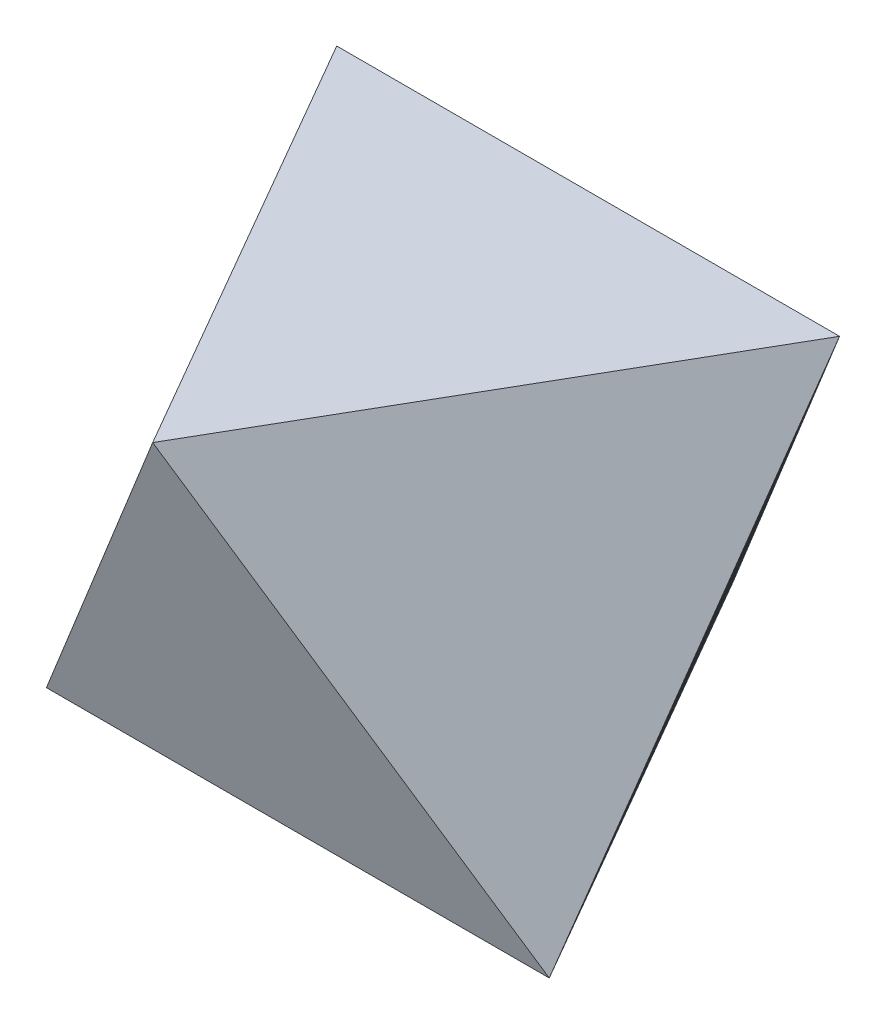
from build123d import *

# Parameters (mm, degrees)
MATRIZC1_3_ANGLE    = 90
MATRIZC1_6_5_ANGLE  = 270
MATRIZC1_5_7_ANGLE  = 270
MATRIZC1_4_9_ANGLE  = 180
MATRIZC1_2_11_ANGLE = 90
MATRIZC1_3_13_ANGLE = 180


with BuildPart() as body_1:
    # Croquis9 → Superficie-Plano2: a flat surface bounded by the sketch
    with BuildSketch(Plane(origin=(0, 408.248290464, 0), x_dir=(1, 0, 0), z_dir=(0, 1, 0)), mode=Mode.PRIVATE) as superficie_plano2_1_region:
        Polygon((0, -288.675134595), (250, 144.337567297), (-250, 144.337567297), align=None)
    superficie_plano2_1 = superficie_plano2_1_region.sketch.faces()[0]
    # Croquis9 → Superficie-Plano2: a flat surface bounded by the sketch
    with BuildSketch(Plane(origin=(0, 408.248290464, 0), x_dir=(1, 0, 0), z_dir=(0, 1, 0)), mode=Mode.PRIVATE) as superficie_plano2_2_region:
        Polygon((0, -288.675134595), (250, 144.337567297), (-250, 144.337567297), align=None)
    superficie_plano2_2 = superficie_plano2_2_region.sketch.faces()[0]
    # MatrizC1: a copy of that surface (a pattern of surface bodies)
    matrizc1_3 = superficie_plano2_2.rotate(Axis((250, 408.248290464, -144.337567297), (-0.7071067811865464, -0.5773502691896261, 0.4082482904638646)), MATRIZC1_3_ANGLE)
    # Croquis7 → Superficie-Plano3: a flat surface bounded by the sketch
    with BuildSketch(Plane(origin=(0, 0, 0), x_dir=(1, 0, 0), z_dir=(0, 1, 0)), mode=Mode.PRIVATE) as superficie_plano3_4_region:
        Polygon((0, 288.675134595), (-250, -144.337567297), (250, -144.337567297), align=None)
    superficie_plano3_4 = superficie_plano3_4_region.sketch.faces()[0]
    # MatrizC1 6: a copy of that surface (a pattern of surface bodies)
    matrizc1_6_5 = superficie_plano3_4.rotate(Axis((250, 408.248290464, -144.337567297), (-0.7071067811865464, -0.5773502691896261, 0.4082482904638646)), MATRIZC1_6_5_ANGLE)
    # Croquis9 → Superficie-Plano2: a flat surface bounded by the sketch
    with BuildSketch(Plane(origin=(0, 408.248290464, 0), x_dir=(1, 0, 0), z_dir=(0, 1, 0)), mode=Mode.PRIVATE) as superficie_plano2_6_region:
        Polygon((0, -288.675134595), (250, 144.337567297), (-250, 144.337567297), align=None)
    superficie_plano2_6 = superficie_plano2_6_region.sketch.faces()[0]
    # MatrizC1 5: a copy of that surface (a pattern of surface bodies)
    matrizc1_5_7 = superficie_plano2_6.rotate(Axis((250, 408.248290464, -144.337567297), (-0.7071067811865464, -0.5773502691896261, 0.4082482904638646)), MATRIZC1_5_7_ANGLE)
    # Croquis7 → Superficie-Plano3: a flat surface bounded by the sketch
    with BuildSketch(Plane(origin=(0, 0, 0), x_dir=(1, 0, 0), z_dir=(0, 1, 0)), mode=Mode.PRIVATE) as superficie_plano3_8_region:
        Polygon((0, 288.675134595), (-250, -144.337567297), (250, -144.337567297), align=None)
    superficie_plano3_8 = superficie_plano3_8_region.sketch.faces()[0]
    # MatrizC1 4: a copy of that surface (a pattern of surface bodies)
    matrizc1_4_9 = superficie_plano3_8.rotate(Axis((250, 408.248290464, -144.337567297), (-0.7071067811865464, -0.5773502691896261, 0.4082482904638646)), MATRIZC1_4_9_ANGLE)
    # Croquis7 → Superficie-Plano3: a flat surface bounded by the sketch
    with BuildSketch(Plane(origin=(0, 0, 0), x_dir=(1, 0, 0), z_dir=(0, 1, 0)), mode=Mode.PRIVATE) as superficie_plano3_10_region:
        Polygon((0, 288.675134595), (-250, -144.337567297), (250, -144.337567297), align=None)
    superficie_plano3_10 = superficie_plano3_10_region.sketch.faces()[0]
    # MatrizC1 2: a copy of that surface (a pattern of surface bodies)
    matrizc1_2_11 = superficie_plano3_10.rotate(Axis((250, 408.248290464, -144.337567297), (-0.7071067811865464, -0.5773502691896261, 0.4082482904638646)), MATRIZC1_2_11_ANGLE)
    # Croquis9 → Superficie-Plano2: a flat surface bounded by the sketch
    with BuildSketch(Plane(origin=(0, 408.248290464, 0), x_dir=(1, 0, 0), z_dir=(0, 1, 0)), mode=Mode.PRIVATE) as superficie_plano2_12_region:
        Polygon((0, -288.675134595), (250, 144.337567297), (-250, 144.337567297), align=None)
    superficie_plano2_12 = superficie_plano2_12_region.sketch.faces()[0]
    # MatrizC1 3: a copy of that surface (a pattern of surface bodies)
    matrizc1_3_13 = superficie_plano2_12.rotate(Axis((250, 408.248290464, -144.337567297), (-0.7071067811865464, -0.5773502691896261, 0.4082482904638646)), MATRIZC1_3_13_ANGLE)
    # Croquis7 → Superficie-Plano3: a flat surface bounded by the sketch
    with BuildSketch(Plane(origin=(0, 0, 0), x_dir=(1, 0, 0), z_dir=(0, 1, 0)), mode=Mode.PRIVATE) as superficie_plano3_14_region:
        Polygon((0, 288.675134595), (-250, -144.337567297), (250, -144.337567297), align=None)
    superficie_plano3_14 = superficie_plano3_14_region.sketch.faces()[0]
    # Superficie-Coser1: the surfaces knitted into a closed skin and filled: a solid
    add(Solid(Shell(Face.sew_faces(superficie_plano2_1.faces() + matrizc1_3.faces() + matrizc1_6_5.faces() + matrizc1_5_7.faces() + matrizc1_4_9.faces() + matrizc1_2_11.faces() + matrizc1_3_13.faces() + superficie_plano3_14.faces())[0])))


solid = body_1.part
